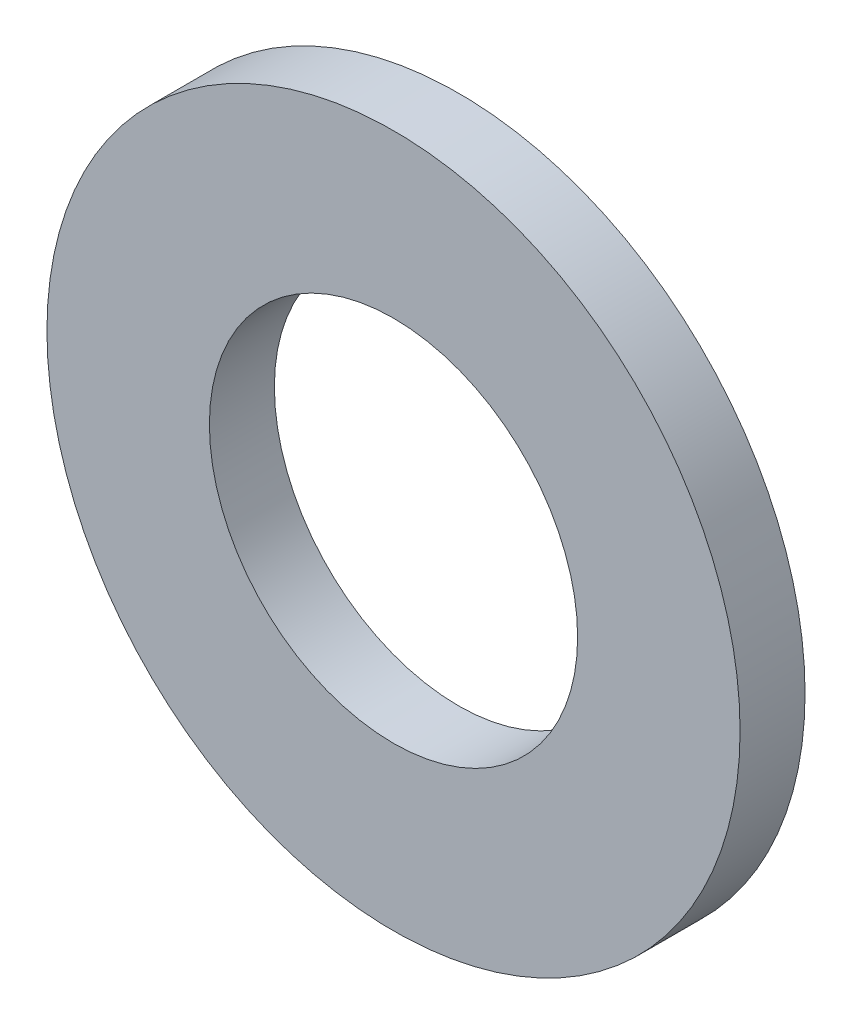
ISO-10303-21;
HEADER;
FILE_DESCRIPTION(('STEP AP214'),'2;1');
FILE_NAME('part.step','',(''),(''),'','','');
FILE_SCHEMA(('AUTOMOTIVE_DESIGN { 1 0 10303 214 1 1 1 1 }'));
ENDSEC;
DATA;
#1=APPLICATION_CONTEXT('core data for automotive mechanical design processes');
#2=APPLICATION_PROTOCOL_DEFINITION('international standard','automotive_design',2000,#1);
#3=PRODUCT_CONTEXT('',#1,'mechanical');
#4=PRODUCT('Part','Part','',(#3));
#5=PRODUCT_RELATED_PRODUCT_CATEGORY('part','',(#4));
#6=PRODUCT_DEFINITION_FORMATION('','',#4);
#7=PRODUCT_DEFINITION_CONTEXT('part definition',#1,'design');
#8=PRODUCT_DEFINITION('design','',#6,#7);
#9=PRODUCT_DEFINITION_SHAPE('','',#8);
#10=(LENGTH_UNIT() NAMED_UNIT(*) SI_UNIT(.MILLI.,.METRE.));
#11=(NAMED_UNIT(*) PLANE_ANGLE_UNIT() SI_UNIT($,.RADIAN.));
#12=(NAMED_UNIT(*) SI_UNIT($,.STERADIAN.) SOLID_ANGLE_UNIT());
#13=UNCERTAINTY_MEASURE_WITH_UNIT(LENGTH_MEASURE(1.E-05),#10,'distance_accuracy_value','');
#14=(GEOMETRIC_REPRESENTATION_CONTEXT(3) GLOBAL_UNCERTAINTY_ASSIGNED_CONTEXT((#13)) GLOBAL_UNIT_ASSIGNED_CONTEXT((#10,
#11,#12)) REPRESENTATION_CONTEXT('',''));
#15=CARTESIAN_POINT('',(0.,0.,0.));
#16=DIRECTION('',(0.,0.,1.));
#17=DIRECTION('',(1.,0.,0.));
#18=AXIS2_PLACEMENT_3D('',#15,#16,#17);
#19=CARTESIAN_POINT('',(0.,0.,-1.5));
#20=DIRECTION('',(0.,0.,1.));
#21=DIRECTION('',(1.,0.,0.));
#22=AXIS2_PLACEMENT_3D('',#19,#20,#21);
#23=CYLINDRICAL_SURFACE('',#22,8.);
#24=CARTESIAN_POINT('',(0.,0.,-1.5));
#25=DIRECTION('',(0.,0.,1.));
#26=DIRECTION('',(1.,0.,0.));
#27=AXIS2_PLACEMENT_3D('',#24,#25,#26);
#28=CIRCLE('',#27,8.);
#29=CARTESIAN_POINT('',(8.,0.,-1.5));
#30=VERTEX_POINT('',#29);
#31=EDGE_CURVE('E10',#30,#30,#28,.T.);
#32=ORIENTED_EDGE('',*,*,#31,.T.);
#33=EDGE_LOOP('',(#32));
#34=FACE_BOUND('',#33,.T.);
#35=CARTESIAN_POINT('',(0.,0.,0.));
#36=DIRECTION('',(0.,0.,1.));
#37=DIRECTION('',(1.,0.,0.));
#38=AXIS2_PLACEMENT_3D('',#35,#36,#37);
#39=CIRCLE('',#38,8.);
#40=CARTESIAN_POINT('',(8.,0.,0.));
#41=VERTEX_POINT('',#40);
#42=EDGE_CURVE('E36',#41,#41,#39,.T.);
#43=ORIENTED_EDGE('',*,*,#42,.F.);
#44=EDGE_LOOP('',(#43));
#45=FACE_BOUND('',#44,.T.);
#46=ADVANCED_FACE('F30',(#34,#45),#23,.T.);
#47=CARTESIAN_POINT('',(0.,0.,-1.5));
#48=DIRECTION('',(0.,0.,1.));
#49=DIRECTION('',(1.,0.,0.));
#50=AXIS2_PLACEMENT_3D('',#47,#48,#49);
#51=PLANE('',#50);
#52=CARTESIAN_POINT('',(0.,0.,-1.5));
#53=DIRECTION('',(0.,0.,1.));
#54=DIRECTION('',(1.,0.,0.));
#55=AXIS2_PLACEMENT_3D('',#52,#53,#54);
#56=CIRCLE('',#55,4.25);
#57=CARTESIAN_POINT('',(4.25,0.,-1.5));
#58=VERTEX_POINT('',#57);
#59=EDGE_CURVE('E40',#58,#58,#56,.T.);
#60=ORIENTED_EDGE('',*,*,#59,.T.);
#61=EDGE_LOOP('',(#60));
#62=FACE_BOUND('',#61,.T.);
#63=ORIENTED_EDGE('',*,*,#31,.F.);
#64=EDGE_LOOP('',(#63));
#65=FACE_BOUND('',#64,.T.);
#66=ADVANCED_FACE('F54',(#62,#65),#51,.F.);
#67=CARTESIAN_POINT('',(0.,0.,0.));
#68=DIRECTION('',(0.,0.,1.));
#69=DIRECTION('',(1.,0.,0.));
#70=AXIS2_PLACEMENT_3D('',#67,#68,#69);
#71=PLANE('',#70);
#72=CARTESIAN_POINT('',(0.,0.,0.));
#73=DIRECTION('',(0.,0.,1.));
#74=DIRECTION('',(1.,0.,0.));
#75=AXIS2_PLACEMENT_3D('',#72,#73,#74);
#76=CIRCLE('',#75,4.25);
#77=CARTESIAN_POINT('',(4.25,0.,0.));
#78=VERTEX_POINT('',#77);
#79=EDGE_CURVE('E44',#78,#78,#76,.T.);
#80=ORIENTED_EDGE('',*,*,#79,.F.);
#81=EDGE_LOOP('',(#80));
#82=FACE_BOUND('',#81,.T.);
#83=ORIENTED_EDGE('',*,*,#42,.T.);
#84=EDGE_LOOP('',(#83));
#85=FACE_BOUND('',#84,.T.);
#86=ADVANCED_FACE('F52',(#82,#85),#71,.T.);
#87=CARTESIAN_POINT('',(0.,0.,-1.5));
#88=DIRECTION('',(0.,0.,1.));
#89=DIRECTION('',(1.,0.,0.));
#90=AXIS2_PLACEMENT_3D('',#87,#88,#89);
#91=CYLINDRICAL_SURFACE('',#90,4.25);
#92=ORIENTED_EDGE('',*,*,#59,.F.);
#93=EDGE_LOOP('',(#92));
#94=FACE_BOUND('',#93,.T.);
#95=ORIENTED_EDGE('',*,*,#79,.T.);
#96=EDGE_LOOP('',(#95));
#97=FACE_BOUND('',#96,.T.);
#98=ADVANCED_FACE('F50',(#94,#97),#91,.F.);
#99=CLOSED_SHELL('',(#46,#66,#86,#98));
#100=MANIFOLD_SOLID_BREP('B2',#99);
#101=ADVANCED_BREP_SHAPE_REPRESENTATION('',(#18,#100),#14);
#102=SHAPE_DEFINITION_REPRESENTATION(#9,#101);
ENDSEC;
END-ISO-10303-21;
